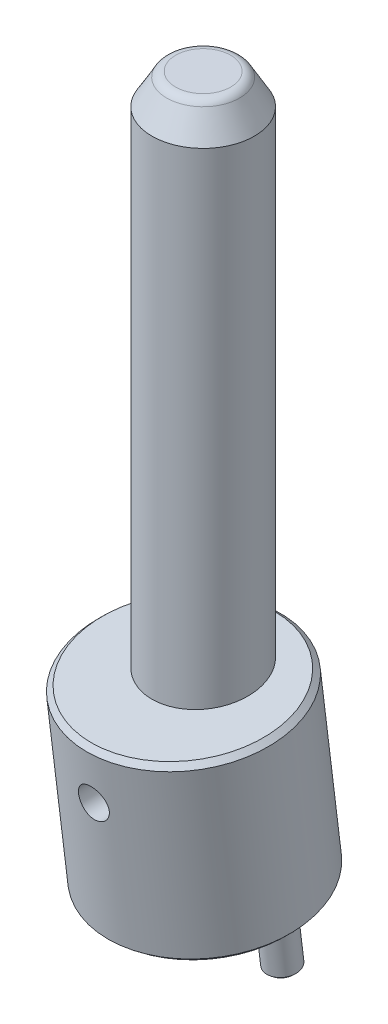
ISO-10303-21;
HEADER;
FILE_DESCRIPTION(('STEP AP214'),'2;1');
FILE_NAME('part.step','',(''),(''),'','','');
FILE_SCHEMA(('AUTOMOTIVE_DESIGN { 1 0 10303 214 1 1 1 1 }'));
ENDSEC;
DATA;
#1=APPLICATION_CONTEXT('core data for automotive mechanical design processes');
#2=APPLICATION_PROTOCOL_DEFINITION('international standard','automotive_design',2000,#1);
#3=PRODUCT_CONTEXT('',#1,'mechanical');
#4=PRODUCT('Part','Part','',(#3));
#5=PRODUCT_RELATED_PRODUCT_CATEGORY('part','',(#4));
#6=PRODUCT_DEFINITION_FORMATION('','',#4);
#7=PRODUCT_DEFINITION_CONTEXT('part definition',#1,'design');
#8=PRODUCT_DEFINITION('design','',#6,#7);
#9=PRODUCT_DEFINITION_SHAPE('','',#8);
#10=(LENGTH_UNIT() NAMED_UNIT(*) SI_UNIT(.MILLI.,.METRE.));
#11=(NAMED_UNIT(*) PLANE_ANGLE_UNIT() SI_UNIT($,.RADIAN.));
#12=(NAMED_UNIT(*) SI_UNIT($,.STERADIAN.) SOLID_ANGLE_UNIT());
#13=UNCERTAINTY_MEASURE_WITH_UNIT(LENGTH_MEASURE(1.E-05),#10,'distance_accuracy_value','');
#14=(GEOMETRIC_REPRESENTATION_CONTEXT(3) GLOBAL_UNCERTAINTY_ASSIGNED_CONTEXT((#13)) GLOBAL_UNIT_ASSIGNED_CONTEXT((#10,
#11,#12)) REPRESENTATION_CONTEXT('',''));
#15=CARTESIAN_POINT('',(0.,0.,0.));
#16=DIRECTION('',(0.,0.,1.));
#17=DIRECTION('',(1.,0.,0.));
#18=AXIS2_PLACEMENT_3D('',#15,#16,#17);
#19=CARTESIAN_POINT('',(0.,130.,0.));
#20=DIRECTION('',(0.,1.,0.));
#21=DIRECTION('',(-1.,0.,0.));
#22=AXIS2_PLACEMENT_3D('',#19,#20,#21);
#23=PLANE('',#22);
#24=CARTESIAN_POINT('',(0.,130.,0.));
#25=DIRECTION('',(0.,-1.,0.));
#26=DIRECTION('',(0.,0.,-1.));
#27=AXIS2_PLACEMENT_3D('',#24,#25,#26);
#28=CIRCLE('',#27,5.381197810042);
#29=CARTESIAN_POINT('',(0.,130.,-5.3811978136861));
#30=VERTEX_POINT('',#29);
#31=CARTESIAN_POINT('',(0.,130.,5.3811978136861));
#32=VERTEX_POINT('',#31);
#33=EDGE_CURVE('P0_E38',#30,#32,#28,.T.);
#34=ORIENTED_EDGE('',*,*,#33,.F.);
#35=CARTESIAN_POINT('',(0.,130.,0.));
#36=DIRECTION('',(0.,-1.,0.));
#37=DIRECTION('',(0.,0.,1.));
#38=AXIS2_PLACEMENT_3D('',#35,#36,#37);
#39=CIRCLE('',#38,5.381197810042);
#40=EDGE_CURVE('P0_E42',#32,#30,#39,.T.);
#41=ORIENTED_EDGE('',*,*,#40,.F.);
#42=EDGE_LOOP('',(#34,#41));
#43=FACE_BOUND('',#42,.T.);
#44=ADVANCED_FACE('P0_F17',(#43),#23,.T.);
#45=CARTESIAN_POINT('',(0.,128.,0.));
#46=DIRECTION('',(0.,1.,0.));
#47=DIRECTION('',(0.00894115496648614,0.,0.999960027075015));
#48=AXIS2_PLACEMENT_3D('',#45,#46,#47);
#49=TOROIDAL_SURFACE('',#48,5.381197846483,2.);
#50=ORIENTED_EDGE('',*,*,#33,.T.);
#51=ORIENTED_EDGE('',*,*,#40,.T.);
#52=EDGE_LOOP('',(#50,#51));
#53=FACE_BOUND('',#52,.T.);
#54=CARTESIAN_POINT('',(0.,129.000000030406,0.));
#55=DIRECTION('',(0.,-1.,0.));
#56=DIRECTION('',(0.,0.,1.));
#57=AXIS2_PLACEMENT_3D('',#54,#55,#56);
#58=CIRCLE('',#57,7.11324863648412);
#59=CARTESIAN_POINT('',(0.,129.000000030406,7.11324863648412));
#60=VERTEX_POINT('',#59);
#61=EDGE_CURVE('P0_E48',#60,#60,#58,.T.);
#62=ORIENTED_EDGE('',*,*,#61,.F.);
#63=EDGE_LOOP('',(#62));
#64=FACE_BOUND('',#63,.T.);
#65=ADVANCED_FACE('P0_F40',(#53,#64),#49,.T.);
#66=CARTESIAN_POINT('',(0.,0.,0.));
#67=DIRECTION('',(0.,1.,0.));
#68=DIRECTION('',(-1.,0.,0.));
#69=AXIS2_PLACEMENT_3D('',#66,#67,#68);
#70=PLANE('',#69);
#71=CARTESIAN_POINT('',(0.,8.84840740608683E-07,0.));
#72=DIRECTION('',(0.,1.,0.));
#73=DIRECTION('',(-1.,0.,0.));
#74=AXIS2_PLACEMENT_3D('',#71,#72,#73);
#75=CIRCLE('',#74,8.99999856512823);
#76=CARTESIAN_POINT('',(-8.99999856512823,8.84840740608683E-07,0.));
#77=VERTEX_POINT('',#76);
#78=EDGE_CURVE('P0_E85',#77,#77,#75,.T.);
#79=ORIENTED_EDGE('',*,*,#78,.F.);
#80=EDGE_LOOP('',(#79));
#81=FACE_BOUND('',#80,.T.);
#82=ADVANCED_FACE('P0_F76',(#81),#70,.F.);
#83=CARTESIAN_POINT('',(0.,17.,3.73205080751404));
#84=DIRECTION('',(0.,0.,1.));
#85=DIRECTION('',(-1.,0.,0.));
#86=AXIS2_PLACEMENT_3D('',#83,#84,#85);
#87=CONICAL_SURFACE('',#86,2.99999999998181,1.04719755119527);
#88=CARTESIAN_POINT('',(0.,16.9999999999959,1.99999999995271));
#89=VERTEX_POINT('',#88);
#90=VERTEX_LOOP('',#89);
#91=FACE_BOUND('',#90,.T.);
#92=CARTESIAN_POINT('',(0.,17.,3.732050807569));
#93=DIRECTION('',(0.,0.,1.));
#94=DIRECTION('',(0.,-1.,0.));
#95=AXIS2_PLACEMENT_3D('',#92,#93,#94);
#96=CIRCLE('',#95,3.);
#97=CARTESIAN_POINT('',(0.,14.,3.732050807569));
#98=VERTEX_POINT('',#97);
#99=EDGE_CURVE('P0_E82',#98,#98,#96,.T.);
#100=ORIENTED_EDGE('',*,*,#99,.T.);
#101=EDGE_LOOP('',(#100));
#102=FACE_BOUND('',#101,.T.);
#103=ADVANCED_FACE('P0_F116',(#91,#102),#87,.F.);
#104=CARTESIAN_POINT('',(0.,123.999999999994,0.));
#105=DIRECTION('',(0.,-1.,0.));
#106=DIRECTION('',(1.,0.,0.));
#107=AXIS2_PLACEMENT_3D('',#104,#105,#106);
#108=CONICAL_SURFACE('',#107,9.9999999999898,0.5235987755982);
#109=CARTESIAN_POINT('',(0.,124.,0.));
#110=DIRECTION('',(0.,1.,0.));
#111=DIRECTION('',(-1.,0.,0.));
#112=AXIS2_PLACEMENT_3D('',#109,#110,#111);
#113=CIRCLE('',#112,10.);
#114=CARTESIAN_POINT('',(-10.,124.,0.));
#115=VERTEX_POINT('',#114);
#116=EDGE_CURVE('P0_E92',#115,#115,#113,.F.);
#117=ORIENTED_EDGE('',*,*,#116,.F.);
#118=EDGE_LOOP('',(#117));
#119=FACE_BOUND('',#118,.T.);
#120=ORIENTED_EDGE('',*,*,#61,.T.);
#121=EDGE_LOOP('',(#120));
#122=FACE_BOUND('',#121,.T.);
#123=ADVANCED_FACE('P0_F108',(#119,#122),#108,.T.);
#124=CARTESIAN_POINT('',(0.,1.00000159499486,0.));
#125=DIRECTION('',(0.,1.,0.));
#126=DIRECTION('',(-1.,0.,0.));
#127=AXIS2_PLACEMENT_3D('',#124,#125,#126);
#128=CONICAL_SURFACE('',#127,9.99999901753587,0.785398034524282);
#129=CARTESIAN_POINT('',(0.,1.000000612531,0.));
#130=DIRECTION('',(0.,1.,0.));
#131=DIRECTION('',(-1.,0.,0.));
#132=AXIS2_PLACEMENT_3D('',#129,#130,#131);
#133=CIRCLE('',#132,10.);
#134=CARTESIAN_POINT('',(-10.,1.000000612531,0.));
#135=VERTEX_POINT('',#134);
#136=EDGE_CURVE('P0_E28',#135,#135,#133,.T.);
#137=ORIENTED_EDGE('',*,*,#136,.F.);
#138=EDGE_LOOP('',(#137));
#139=FACE_BOUND('',#138,.T.);
#140=ORIENTED_EDGE('',*,*,#78,.T.);
#141=EDGE_LOOP('',(#140));
#142=FACE_BOUND('',#141,.T.);
#143=ADVANCED_FACE('P0_F105',(#139,#142),#128,.T.);
#144=CARTESIAN_POINT('',(0.,17.,1.5));
#145=DIRECTION('',(0.,0.,1.));
#146=DIRECTION('',(0.,-1.,0.));
#147=AXIS2_PLACEMENT_3D('',#144,#145,#146);
#148=CYLINDRICAL_SURFACE('',#147,3.);
#149=ORIENTED_EDGE('',*,*,#99,.F.);
#150=EDGE_LOOP('',(#149));
#151=FACE_BOUND('',#150,.T.);
#152=CARTESIAN_POINT('',(0.,14.,10.));
#153=CARTESIAN_POINT('',(-0.164364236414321,14.0000089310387,9.99999407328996));
#154=CARTESIAN_POINT('',(-0.328908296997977,14.0135695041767,9.99590322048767));
#155=CARTESIAN_POINT('',(-0.653366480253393,14.0673818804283,9.9799606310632));
#156=CARTESIAN_POINT('',(-0.813271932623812,14.1076806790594,9.96809523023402));
#157=CARTESIAN_POINT('',(-1.12348315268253,14.2135007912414,9.93790838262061));
#158=CARTESIAN_POINT('',(-1.27380789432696,14.2789703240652,9.91960019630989));
#159=CARTESIAN_POINT('',(-1.56129290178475,14.4330996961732,9.87843514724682));
#160=CARTESIAN_POINT('',(-1.69845550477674,14.5217554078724,9.85557909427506));
#161=CARTESIAN_POINT('',(-1.95973946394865,14.7224452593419,9.80701539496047));
#162=CARTESIAN_POINT('',(-2.08342924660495,14.8350271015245,9.78124907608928));
#163=CARTESIAN_POINT('',(-2.31049290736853,15.0792112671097,9.73011807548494));
#164=CARTESIAN_POINT('',(-2.41386225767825,15.2108178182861,9.70475348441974));
#165=CARTESIAN_POINT('',(-2.59960101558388,15.4929419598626,9.65668220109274));
#166=CARTESIAN_POINT('',(-2.68144668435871,15.6438178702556,9.63404799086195));
#167=CARTESIAN_POINT('',(-2.81842825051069,15.9579795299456,9.59487230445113));
#168=CARTESIAN_POINT('',(-2.87357072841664,16.1212622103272,9.57832932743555));
#169=CARTESIAN_POINT('',(-2.95403265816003,16.4507804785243,9.5538174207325));
#170=CARTESIAN_POINT('',(-2.98014390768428,16.6168053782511,9.54562139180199));
#171=CARTESIAN_POINT('',(-3.00427461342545,16.9510662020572,9.53805579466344));
#172=CARTESIAN_POINT('',(-3.00230085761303,17.1193015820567,9.53868409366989));
#173=CARTESIAN_POINT('',(-2.9709395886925,17.4467673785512,9.54849486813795));
#174=CARTESIAN_POINT('',(-2.94254427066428,17.6061036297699,9.55736772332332));
#175=CARTESIAN_POINT('',(-2.86074869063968,17.9176387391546,9.58216703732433));
#176=CARTESIAN_POINT('',(-2.80734582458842,18.0698368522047,9.59809423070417));
#177=CARTESIAN_POINT('',(-2.67631861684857,18.3652051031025,9.6354552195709));
#178=CARTESIAN_POINT('',(-2.59837186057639,18.5082226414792,9.65696160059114));
#179=CARTESIAN_POINT('',(-2.42069837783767,18.7794716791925,9.70302119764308));
#180=CARTESIAN_POINT('',(-2.32096766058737,18.9077004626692,9.7275749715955));
#181=CARTESIAN_POINT('',(-2.09764727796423,19.1513495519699,9.77821549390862));
#182=CARTESIAN_POINT('',(-1.97323765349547,19.2660150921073,9.80432352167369));
#183=CARTESIAN_POINT('',(-1.7065766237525,19.4730741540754,9.85423611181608));
#184=CARTESIAN_POINT('',(-1.56431758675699,19.5654580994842,9.87803968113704));
#185=CARTESIAN_POINT('',(-1.26458300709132,19.7257915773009,9.92088257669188));
#186=CARTESIAN_POINT('',(-1.10700242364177,19.7935547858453,9.93988525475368));
#187=CARTESIAN_POINT('',(-0.782158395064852,19.9012737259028,9.97069163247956));
#188=CARTESIAN_POINT('',(-0.61491570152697,19.9412868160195,9.9825101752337));
#189=CARTESIAN_POINT('',(-0.371824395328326,19.9778051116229,9.99335985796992));
#190=CARTESIAN_POINT('',(-0.297737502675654,19.9861188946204,9.99584304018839));
#191=CARTESIAN_POINT('',(-0.14911274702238,19.9972183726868,9.99916445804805));
#192=CARTESIAN_POINT('',(-0.0745748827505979,20.000004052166,10.0000026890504));
#193=CARTESIAN_POINT('',(0.164364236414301,19.9999910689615,9.99999407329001));
#194=CARTESIAN_POINT('',(0.328908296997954,19.9864304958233,9.99590322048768));
#195=CARTESIAN_POINT('',(0.653366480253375,19.9326181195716,9.97996063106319));
#196=CARTESIAN_POINT('',(0.813271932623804,19.8923193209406,9.96809523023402));
#197=CARTESIAN_POINT('',(1.12348315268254,19.7864992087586,9.93790838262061));
#198=CARTESIAN_POINT('',(1.27380789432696,19.7210296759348,9.91960019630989));
#199=CARTESIAN_POINT('',(1.56129290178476,19.5669003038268,9.87843514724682));
#200=CARTESIAN_POINT('',(1.69845550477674,19.4782445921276,9.85557909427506));
#201=CARTESIAN_POINT('',(1.95973946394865,19.2775547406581,9.80701539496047));
#202=CARTESIAN_POINT('',(2.08342924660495,19.1649728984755,9.78124907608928));
#203=CARTESIAN_POINT('',(2.31049290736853,18.9207887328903,9.73011807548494));
#204=CARTESIAN_POINT('',(2.41386225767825,18.7891821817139,9.70475348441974));
#205=CARTESIAN_POINT('',(2.59960101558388,18.5070580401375,9.65668220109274));
#206=CARTESIAN_POINT('',(2.68144668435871,18.3561821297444,9.63404799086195));
#207=CARTESIAN_POINT('',(2.81842825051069,18.0420204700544,9.59487230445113));
#208=CARTESIAN_POINT('',(2.87357072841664,17.8787377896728,9.57832932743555));
#209=CARTESIAN_POINT('',(2.95403265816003,17.5492195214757,9.5538174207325));
#210=CARTESIAN_POINT('',(2.98014390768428,17.3831946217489,9.54562139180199));
#211=CARTESIAN_POINT('',(3.00427461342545,17.0489337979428,9.53805579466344));
#212=CARTESIAN_POINT('',(3.00230085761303,16.8806984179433,9.53868409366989));
#213=CARTESIAN_POINT('',(2.9709395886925,16.5532326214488,9.54849486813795));
#214=CARTESIAN_POINT('',(2.94254427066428,16.3938963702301,9.55736772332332));
#215=CARTESIAN_POINT('',(2.86074869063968,16.0823612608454,9.58216703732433));
#216=CARTESIAN_POINT('',(2.80734582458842,15.9301631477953,9.59809423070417));
#217=CARTESIAN_POINT('',(2.67631861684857,15.6347948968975,9.6354552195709));
#218=CARTESIAN_POINT('',(2.59837186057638,15.4917773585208,9.65696160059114));
#219=CARTESIAN_POINT('',(2.42069837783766,15.2205283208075,9.70302119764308));
#220=CARTESIAN_POINT('',(2.32096766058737,15.0922995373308,9.7275749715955));
#221=CARTESIAN_POINT('',(2.09764727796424,14.8486504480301,9.77821549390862));
#222=CARTESIAN_POINT('',(1.97323765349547,14.7339849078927,9.80432352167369));
#223=CARTESIAN_POINT('',(1.7065766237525,14.5269258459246,9.85423611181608));
#224=CARTESIAN_POINT('',(1.56431758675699,14.4345419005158,9.87803968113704));
#225=CARTESIAN_POINT('',(1.26458300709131,14.2742084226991,9.92088257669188));
#226=CARTESIAN_POINT('',(1.10700242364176,14.2064452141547,9.93988525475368));
#227=CARTESIAN_POINT('',(0.782158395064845,14.0987262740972,9.97069163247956));
#228=CARTESIAN_POINT('',(0.614915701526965,14.0587131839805,9.9825101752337));
#229=CARTESIAN_POINT('',(0.371824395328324,14.0221948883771,9.99335985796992));
#230=CARTESIAN_POINT('',(0.297737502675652,14.0138811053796,9.9958430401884));
#231=CARTESIAN_POINT('',(0.149112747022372,14.0027816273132,9.99916445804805));
#232=CARTESIAN_POINT('',(0.0745748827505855,13.999995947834,10.0000026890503));
#233=CARTESIAN_POINT('',(0.,14.,10.));
#234=B_SPLINE_CURVE_WITH_KNOTS('',3,(#152,#153,#154,#155,#156,#157,#158,#159,#160,#161,#162,
#163,#164,#165,#166,#167,#168,#169,#170,#171,#172,#173,#174,#175,#176,#177,#178,#179,#180,#181,
#182,#183,#184,#185,#186,#187,#188,#189,#190,#191,#192,#193,#194,#195,#196,#197,#198,#199,#200,
#201,#202,#203,#204,#205,#206,#207,#208,#209,#210,#211,#212,#213,#214,#215,#216,#217,#218,#219,
#220,#221,#222,#223,#224,#225,#226,#227,#228,#229,#230,#231,#232,#233),.UNSPECIFIED.,.T.,.F.,(4,
2,2,2,2,2,2,2,2,2,2,2,2,2,2,2,2,2,2,2,2,2,2,2,2,2,2,2,2,2,2,2,2,2,2,2,2,2,2,2,4),(0.,
0.49280574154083,0.98647994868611,1.47914396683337,1.97172034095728,2.47709830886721,
2.98258875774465,3.49943124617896,4.01614630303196,4.51839363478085,5.02051957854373,
5.50451902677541,5.98856888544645,6.47926306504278,6.97004721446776,7.48124851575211,
7.99266913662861,8.507883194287,9.02202912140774,9.24562293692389,9.4692173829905,
9.96202312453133,10.4556973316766,10.9483613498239,11.4409377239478,11.9463156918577,
12.4518061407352,12.9686486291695,13.4853636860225,13.9876110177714,14.4897369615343,
14.9737364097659,15.457786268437,15.9484804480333,16.4392645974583,16.9504658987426,
17.4618865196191,17.9771005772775,18.4912465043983,18.7148403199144,18.938434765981),.UNSPECIFIED.);
#235=CARTESIAN_POINT('',(0.,14.,10.));
#236=VERTEX_POINT('',#235);
#237=EDGE_CURVE('P0_E11',#236,#236,#234,.T.);
#238=ORIENTED_EDGE('',*,*,#237,.F.);
#239=EDGE_LOOP('',(#238));
#240=FACE_BOUND('',#239,.T.);
#241=ADVANCED_FACE('P0_F107',(#151,#240),#148,.F.);
#242=CARTESIAN_POINT('',(0.,-6.5,0.));
#243=DIRECTION('',(0.,1.,0.));
#244=DIRECTION('',(-1.,0.,0.));
#245=AXIS2_PLACEMENT_3D('',#242,#243,#244);
#246=CYLINDRICAL_SURFACE('',#245,10.);
#247=ORIENTED_EDGE('',*,*,#116,.T.);
#248=EDGE_LOOP('',(#247));
#249=FACE_BOUND('',#248,.T.);
#250=ORIENTED_EDGE('',*,*,#136,.T.);
#251=EDGE_LOOP('',(#250));
#252=FACE_BOUND('',#251,.T.);
#253=ORIENTED_EDGE('',*,*,#237,.T.);
#254=EDGE_LOOP('',(#253));
#255=FACE_BOUND('',#254,.T.);
#256=ADVANCED_FACE('P0_F102',(#249,#252,#255),#246,.T.);
#257=CLOSED_SHELL('',(#44,#65,#82,#103,#123,#143,#241,#256));
#258=MANIFOLD_SOLID_BREP('P0_B1',#257);
#259=CARTESIAN_POINT('',(0.,-15.1520541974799,-1.51393584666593));
#260=DIRECTION('',(0.,-0.992546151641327,-0.121869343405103));
#261=DIRECTION('',(0.,0.121869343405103,-0.992546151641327));
#262=AXIS2_PLACEMENT_3D('',#259,#260,#261);
#263=PLANE('',#262);
#264=CARTESIAN_POINT('',(-14.,-15.1520541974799,-1.51393584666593));
#265=DIRECTION('',(0.,-0.992546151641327,-0.121869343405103));
#266=DIRECTION('',(0.,0.121869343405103,-0.992546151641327));
#267=AXIS2_PLACEMENT_3D('',#264,#265,#266);
#268=CIRCLE('',#267,2.49998893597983);
#269=CARTESIAN_POINT('',(-14.,-14.8473821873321,-3.99529024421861));
#270=VERTEX_POINT('',#269);
#271=EDGE_CURVE('P1_E17',#270,#270,#268,.F.);
#272=ORIENTED_EDGE('',*,*,#271,.F.);
#273=EDGE_LOOP('',(#272));
#274=FACE_BOUND('',#273,.T.);
#275=ADVANCED_FACE('P1_F14',(#274),#263,.T.);
#276=CARTESIAN_POINT('',(0.,-15.1520541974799,-1.51393584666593));
#277=DIRECTION('',(0.,-0.992546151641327,-0.121869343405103));
#278=DIRECTION('',(0.,0.121869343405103,-0.992546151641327));
#279=AXIS2_PLACEMENT_3D('',#276,#277,#278);
#280=PLANE('',#279);
#281=CARTESIAN_POINT('',(14.,-15.1520541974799,-1.51393584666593));
#282=DIRECTION('',(0.,-0.992546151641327,-0.121869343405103));
#283=DIRECTION('',(0.,0.121869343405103,-0.992546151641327));
#284=AXIS2_PLACEMENT_3D('',#281,#282,#283);
#285=CIRCLE('',#284,2.49998893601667);
#286=CARTESIAN_POINT('',(14.,-14.8473821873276,-3.99529024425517));
#287=VERTEX_POINT('',#286);
#288=EDGE_CURVE('P1_E114',#287,#287,#285,.F.);
#289=ORIENTED_EDGE('',*,*,#288,.F.);
#290=EDGE_LOOP('',(#289));
#291=FACE_BOUND('',#290,.T.);
#292=ADVANCED_FACE('P1_F104',(#291),#280,.T.);
#293=CARTESIAN_POINT('',(0.,-1.32706345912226E-13,-3.20815422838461E-13));
#294=DIRECTION('',(0.,-1.,0.));
#295=DIRECTION('',(0.,0.,-1.));
#296=AXIS2_PLACEMENT_3D('',#293,#294,#295);
#297=PLANE('',#296);
#298=CARTESIAN_POINT('',(0.,0.,-2.03098171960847E-12));
#299=DIRECTION('',(0.,-1.,0.));
#300=DIRECTION('',(0.,0.,-1.));
#301=AXIS2_PLACEMENT_3D('',#298,#299,#300);
#302=CIRCLE('',#301,10.);
#303=CARTESIAN_POINT('',(0.,0.,-10.000000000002));
#304=VERTEX_POINT('',#303);
#305=EDGE_CURVE('P1_E116',#304,#304,#302,.F.);
#306=ORIENTED_EDGE('',*,*,#305,.T.);
#307=EDGE_LOOP('',(#306));
#308=FACE_BOUND('',#307,.T.);
#309=ADVANCED_FACE('P1_F101',(#308),#297,.F.);
#310=CARTESIAN_POINT('',(-14.,-14.6557726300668,-1.45300013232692));
#311=DIRECTION('',(0.,0.992546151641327,0.121869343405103));
#312=DIRECTION('',(0.,-0.121869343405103,0.992546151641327));
#313=AXIS2_PLACEMENT_3D('',#310,#311,#312);
#314=CONICAL_SURFACE('',#313,2.99999527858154,0.785395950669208);
#315=CARTESIAN_POINT('',(-14.,-14.6557679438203,-1.4529995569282));
#316=DIRECTION('',(0.,0.992546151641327,0.121869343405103));
#317=DIRECTION('',(0.,-0.121869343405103,0.992546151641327));
#318=AXIS2_PLACEMENT_3D('',#315,#316,#317);
#319=CIRCLE('',#318,3.);
#320=CARTESIAN_POINT('',(-14.,-15.0213759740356,1.52463889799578));
#321=VERTEX_POINT('',#320);
#322=EDGE_CURVE('P1_E118',#321,#321,#319,.T.);
#323=ORIENTED_EDGE('',*,*,#322,.F.);
#324=EDGE_LOOP('',(#323));
#325=FACE_BOUND('',#324,.T.);
#326=ORIENTED_EDGE('',*,*,#271,.T.);
#327=EDGE_LOOP('',(#326));
#328=FACE_BOUND('',#327,.T.);
#329=ADVANCED_FACE('P1_F97',(#325,#328),#314,.T.);
#330=CARTESIAN_POINT('',(14.,-14.6557726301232,-1.45300013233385));
#331=DIRECTION('',(0.,0.992546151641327,0.121869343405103));
#332=DIRECTION('',(0.,-0.121869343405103,0.992546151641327));
#333=AXIS2_PLACEMENT_3D('',#330,#331,#332);
#334=CONICAL_SURFACE('',#333,2.99999527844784,0.785395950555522);
#335=CARTESIAN_POINT('',(14.,-14.655767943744,-1.45299955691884));
#336=DIRECTION('',(0.,0.992546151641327,0.121869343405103));
#337=DIRECTION('',(0.,-0.121869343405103,0.992546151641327));
#338=AXIS2_PLACEMENT_3D('',#335,#336,#337);
#339=CIRCLE('',#338,3.);
#340=CARTESIAN_POINT('',(14.,-15.0213759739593,1.52463889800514));
#341=VERTEX_POINT('',#340);
#342=EDGE_CURVE('P1_E123',#341,#341,#339,.T.);
#343=ORIENTED_EDGE('',*,*,#342,.F.);
#344=EDGE_LOOP('',(#343));
#345=FACE_BOUND('',#344,.T.);
#346=ORIENTED_EDGE('',*,*,#288,.T.);
#347=EDGE_LOOP('',(#346));
#348=FACE_BOUND('',#347,.T.);
#349=ADVANCED_FACE('P1_F92',(#345,#348),#334,.T.);
#350=CARTESIAN_POINT('',(0.,43.3305704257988,-2.03092750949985E-12));
#351=DIRECTION('',(0.,-1.,0.));
#352=DIRECTION('',(0.,0.,-1.));
#353=AXIS2_PLACEMENT_3D('',#350,#351,#352);
#354=CYLINDRICAL_SURFACE('',#353,10.);
#355=CARTESIAN_POINT('',(0.,30.0000000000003,-2.03092750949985E-12));
#356=DIRECTION('',(0.,0.992546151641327,0.121869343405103));
#357=DIRECTION('',(0.,-0.121869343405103,0.992546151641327));
#358=AXIS2_PLACEMENT_3D('',#355,#356,#357);
#359=ELLIPSE('',#358,10.0750982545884,10.);
#360=CARTESIAN_POINT('',(0.,28.7721543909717,9.99999999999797));
#361=VERTEX_POINT('',#360);
#362=EDGE_CURVE('P1_E79',#361,#361,#359,.F.);
#363=ORIENTED_EDGE('',*,*,#362,.F.);
#364=EDGE_LOOP('',(#363));
#365=FACE_BOUND('',#364,.T.);
#366=ORIENTED_EDGE('',*,*,#305,.F.);
#367=EDGE_LOOP('',(#366));
#368=FACE_BOUND('',#367,.T.);
#369=CARTESIAN_POINT('',(0.,20.0000000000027,9.99999999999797));
#370=CARTESIAN_POINT('',(-0.16436423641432,19.999991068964,9.99999407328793));
#371=CARTESIAN_POINT('',(-0.328908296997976,19.986430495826,9.99590322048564));
#372=CARTESIAN_POINT('',(-0.653366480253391,19.9326181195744,9.97996063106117));
#373=CARTESIAN_POINT('',(-0.81327193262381,19.8923193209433,9.96809523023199));
#374=CARTESIAN_POINT('',(-1.12348315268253,19.7864992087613,9.93790838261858));
#375=CARTESIAN_POINT('',(-1.27380789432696,19.7210296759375,9.91960019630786));
#376=CARTESIAN_POINT('',(-1.56129290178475,19.5669003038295,9.87843514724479));
#377=CARTESIAN_POINT('',(-1.69845550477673,19.4782445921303,9.85557909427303));
#378=CARTESIAN_POINT('',(-1.95973946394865,19.2775547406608,9.80701539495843));
#379=CARTESIAN_POINT('',(-2.08342924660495,19.1649728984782,9.78124907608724));
#380=CARTESIAN_POINT('',(-2.31049290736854,18.920788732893,9.73011807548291));
#381=CARTESIAN_POINT('',(-2.41386225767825,18.7891821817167,9.70475348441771));
#382=CARTESIAN_POINT('',(-2.59960101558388,18.5070580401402,9.65668220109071));
#383=CARTESIAN_POINT('',(-2.68144668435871,18.3561821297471,9.63404799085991));
#384=CARTESIAN_POINT('',(-2.81842825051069,18.0420204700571,9.5948723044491));
#385=CARTESIAN_POINT('',(-2.87357072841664,17.8787377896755,9.57832932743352));
#386=CARTESIAN_POINT('',(-2.95403265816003,17.5492195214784,9.55381742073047));
#387=CARTESIAN_POINT('',(-2.98014390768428,17.3831946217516,9.54562139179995));
#388=CARTESIAN_POINT('',(-3.00427461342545,17.0489337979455,9.53805579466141));
#389=CARTESIAN_POINT('',(-3.00230085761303,16.8806984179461,9.53868409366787));
#390=CARTESIAN_POINT('',(-2.9709395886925,16.5532326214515,9.54849486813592));
#391=CARTESIAN_POINT('',(-2.94254427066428,16.3938963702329,9.55736772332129));
#392=CARTESIAN_POINT('',(-2.86074869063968,16.0823612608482,9.5821670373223));
#393=CARTESIAN_POINT('',(-2.80734582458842,15.9301631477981,9.59809423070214));
#394=CARTESIAN_POINT('',(-2.67631861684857,15.6347948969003,9.63545521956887));
#395=CARTESIAN_POINT('',(-2.59837186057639,15.4917773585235,9.65696160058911));
#396=CARTESIAN_POINT('',(-2.42069837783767,15.2205283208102,9.70302119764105));
#397=CARTESIAN_POINT('',(-2.32096766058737,15.0922995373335,9.72757497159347));
#398=CARTESIAN_POINT('',(-2.09764727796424,14.8486504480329,9.77821549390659));
#399=CARTESIAN_POINT('',(-1.97323765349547,14.7339849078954,9.80432352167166));
#400=CARTESIAN_POINT('',(-1.7065766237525,14.5269258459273,9.85423611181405));
#401=CARTESIAN_POINT('',(-1.56431758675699,14.4345419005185,9.87803968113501));
#402=CARTESIAN_POINT('',(-1.26458300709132,14.2742084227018,9.92088257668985));
#403=CARTESIAN_POINT('',(-1.10700242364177,14.2064452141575,9.93988525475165));
#404=CARTESIAN_POINT('',(-0.782158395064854,14.0987262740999,9.97069163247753));
#405=CARTESIAN_POINT('',(-0.614915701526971,14.0587131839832,9.98251017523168));
#406=CARTESIAN_POINT('',(-0.371824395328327,14.0221948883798,9.99335985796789));
#407=CARTESIAN_POINT('',(-0.297737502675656,14.0138811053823,9.99584304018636));
#408=CARTESIAN_POINT('',(-0.149112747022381,14.0027816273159,9.99916445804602));
#409=CARTESIAN_POINT('',(-0.0745748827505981,13.9999959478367,10.0000026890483));
#410=CARTESIAN_POINT('',(0.164364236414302,14.0000089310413,9.99999407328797));
#411=CARTESIAN_POINT('',(0.328908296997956,14.0135695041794,9.99590322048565));
#412=CARTESIAN_POINT('',(0.653366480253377,14.0673818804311,9.97996063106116));
#413=CARTESIAN_POINT('',(0.813271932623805,14.1076806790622,9.96809523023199));
#414=CARTESIAN_POINT('',(1.12348315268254,14.2135007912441,9.93790838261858));
#415=CARTESIAN_POINT('',(1.27380789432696,14.2789703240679,9.91960019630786));
#416=CARTESIAN_POINT('',(1.56129290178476,14.4330996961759,9.87843514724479));
#417=CARTESIAN_POINT('',(1.69845550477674,14.5217554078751,9.85557909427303));
#418=CARTESIAN_POINT('',(1.95973946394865,14.7224452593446,9.80701539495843));
#419=CARTESIAN_POINT('',(2.08342924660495,14.8350271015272,9.78124907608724));
#420=CARTESIAN_POINT('',(2.31049290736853,15.0792112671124,9.73011807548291));
#421=CARTESIAN_POINT('',(2.41386225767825,15.2108178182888,9.70475348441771));
#422=CARTESIAN_POINT('',(2.59960101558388,15.4929419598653,9.65668220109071));
#423=CARTESIAN_POINT('',(2.68144668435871,15.6438178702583,9.63404799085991));
#424=CARTESIAN_POINT('',(2.81842825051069,15.9579795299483,9.5948723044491));
#425=CARTESIAN_POINT('',(2.87357072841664,16.1212622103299,9.57832932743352));
#426=CARTESIAN_POINT('',(2.95403265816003,16.450780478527,9.55381742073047));
#427=CARTESIAN_POINT('',(2.98014390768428,16.6168053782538,9.54562139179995));
#428=CARTESIAN_POINT('',(3.00427461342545,16.9510662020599,9.53805579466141));
#429=CARTESIAN_POINT('',(3.00230085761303,17.1193015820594,9.53868409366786));
#430=CARTESIAN_POINT('',(2.9709395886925,17.4467673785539,9.54849486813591));
#431=CARTESIAN_POINT('',(2.94254427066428,17.6061036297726,9.55736772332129));
#432=CARTESIAN_POINT('',(2.86074869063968,17.9176387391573,9.5821670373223));
#433=CARTESIAN_POINT('',(2.80734582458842,18.0698368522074,9.59809423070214));
#434=CARTESIAN_POINT('',(2.67631861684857,18.3652051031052,9.63545521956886));
#435=CARTESIAN_POINT('',(2.59837186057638,18.5082226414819,9.65696160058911));
#436=CARTESIAN_POINT('',(2.42069837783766,18.7794716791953,9.70302119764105));
#437=CARTESIAN_POINT('',(2.32096766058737,18.9077004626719,9.72757497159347));
#438=CARTESIAN_POINT('',(2.09764727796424,19.1513495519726,9.77821549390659));
#439=CARTESIAN_POINT('',(1.97323765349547,19.26601509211,9.80432352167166));
#440=CARTESIAN_POINT('',(1.7065766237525,19.4730741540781,9.85423611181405));
#441=CARTESIAN_POINT('',(1.56431758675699,19.5654580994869,9.87803968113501));
#442=CARTESIAN_POINT('',(1.26458300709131,19.7257915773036,9.92088257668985));
#443=CARTESIAN_POINT('',(1.10700242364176,19.793554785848,9.93988525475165));
#444=CARTESIAN_POINT('',(0.782158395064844,19.9012737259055,9.97069163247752));
#445=CARTESIAN_POINT('',(0.614915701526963,19.9412868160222,9.98251017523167));
#446=CARTESIAN_POINT('',(0.371824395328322,19.9778051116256,9.99335985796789));
#447=CARTESIAN_POINT('',(0.297737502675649,19.9861188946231,9.99584304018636));
#448=CARTESIAN_POINT('',(0.149112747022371,19.9972183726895,9.99916445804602));
#449=CARTESIAN_POINT('',(0.0745748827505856,20.0000040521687,10.0000026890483));
#450=CARTESIAN_POINT('',(0.,20.0000000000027,9.99999999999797));
#451=B_SPLINE_CURVE_WITH_KNOTS('',3,(#369,#370,#371,#372,#373,#374,#375,#376,#377,#378,#379,
#380,#381,#382,#383,#384,#385,#386,#387,#388,#389,#390,#391,#392,#393,#394,#395,#396,#397,#398,
#399,#400,#401,#402,#403,#404,#405,#406,#407,#408,#409,#410,#411,#412,#413,#414,#415,#416,#417,
#418,#419,#420,#421,#422,#423,#424,#425,#426,#427,#428,#429,#430,#431,#432,#433,#434,#435,#436,
#437,#438,#439,#440,#441,#442,#443,#444,#445,#446,#447,#448,#449,#450),.UNSPECIFIED.,.T.,.F.,(4,
2,2,2,2,2,2,2,2,2,2,2,2,2,2,2,2,2,2,2,2,2,2,2,2,2,2,2,2,2,2,2,2,2,2,2,2,2,2,2,4),(0.,
0.49280574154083,0.986479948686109,1.47914396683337,1.97172034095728,2.47709830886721,
2.98258875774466,3.49943124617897,4.01614630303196,4.51839363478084,5.02051957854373,
5.50451902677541,5.98856888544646,6.47926306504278,6.97004721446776,7.48124851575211,
7.99266913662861,8.507883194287,9.02202912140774,9.24562293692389,9.46921738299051,
9.96202312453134,10.4556973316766,10.9483613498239,11.4409377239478,11.9463156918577,
12.4518061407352,12.9686486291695,13.4853636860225,13.9876110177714,14.4897369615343,
14.9737364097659,15.457786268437,15.9484804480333,16.4392645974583,16.9504658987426,
17.4618865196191,17.9771005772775,18.4912465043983,18.7148403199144,18.9384347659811),.UNSPECIFIED.);
#452=CARTESIAN_POINT('',(0.,20.0000000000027,9.99999999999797));
#453=VERTEX_POINT('',#452);
#454=EDGE_CURVE('P1_E76',#453,#453,#451,.T.);
#455=ORIENTED_EDGE('',*,*,#454,.T.);
#456=EDGE_LOOP('',(#455));
#457=FACE_BOUND('',#456,.T.);
#458=ADVANCED_FACE('P1_F86',(#365,#368,#457),#354,.F.);
#459=CARTESIAN_POINT('',(-14.,-6.219138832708,-0.41711175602));
#460=DIRECTION('',(0.,-0.992546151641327,-0.121869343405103));
#461=DIRECTION('',(0.,0.121869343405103,-0.992546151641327));
#462=AXIS2_PLACEMENT_3D('',#459,#460,#461);
#463=CYLINDRICAL_SURFACE('',#462,3.);
#464=CARTESIAN_POINT('',(-14.,-6.219138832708,-0.41711175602));
#465=DIRECTION('',(0.,-0.992546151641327,-0.121869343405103));
#466=DIRECTION('',(0.,0.121869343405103,-0.992546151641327));
#467=AXIS2_PLACEMENT_3D('',#464,#465,#466);
#468=CIRCLE('',#467,3.);
#469=CARTESIAN_POINT('',(-14.,-5.85353080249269,-3.39475021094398));
#470=VERTEX_POINT('',#469);
#471=EDGE_CURVE('P1_E72',#470,#470,#468,.T.);
#472=ORIENTED_EDGE('',*,*,#471,.T.);
#473=EDGE_LOOP('',(#472));
#474=FACE_BOUND('',#473,.T.);
#475=ORIENTED_EDGE('',*,*,#322,.T.);
#476=EDGE_LOOP('',(#475));
#477=FACE_BOUND('',#476,.T.);
#478=ADVANCED_FACE('P1_F91',(#474,#477),#463,.T.);
#479=CARTESIAN_POINT('',(14.,-6.219138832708,-0.41711175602));
#480=DIRECTION('',(0.,-0.992546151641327,-0.121869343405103));
#481=DIRECTION('',(0.,0.121869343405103,-0.992546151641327));
#482=AXIS2_PLACEMENT_3D('',#479,#480,#481);
#483=CYLINDRICAL_SURFACE('',#482,3.);
#484=CARTESIAN_POINT('',(14.,-6.219138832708,-0.41711175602));
#485=DIRECTION('',(0.,-0.992546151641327,-0.121869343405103));
#486=DIRECTION('',(0.,0.121869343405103,-0.992546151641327));
#487=AXIS2_PLACEMENT_3D('',#484,#485,#486);
#488=CIRCLE('',#487,3.);
#489=CARTESIAN_POINT('',(14.,-5.85353080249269,-3.39475021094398));
#490=VERTEX_POINT('',#489);
#491=EDGE_CURVE('P1_E68',#490,#490,#488,.T.);
#492=ORIENTED_EDGE('',*,*,#491,.T.);
#493=EDGE_LOOP('',(#492));
#494=FACE_BOUND('',#493,.T.);
#495=ORIENTED_EDGE('',*,*,#342,.T.);
#496=EDGE_LOOP('',(#495));
#497=FACE_BOUND('',#496,.T.);
#498=ADVANCED_FACE('P1_F139',(#494,#497),#483,.T.);
#499=CARTESIAN_POINT('',(0.,29.5125226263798,3.97018460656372));
#500=DIRECTION('',(0.,0.992546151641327,0.121869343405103));
#501=DIRECTION('',(0.,-0.121869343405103,0.992546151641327));
#502=AXIS2_PLACEMENT_3D('',#499,#500,#501);
#503=PLANE('',#502);
#504=ORIENTED_EDGE('',*,*,#362,.T.);
#505=EDGE_LOOP('',(#504));
#506=FACE_BOUND('',#505,.T.);
#507=CARTESIAN_POINT('',(0.,29.5125226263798,3.9701846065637));
#508=DIRECTION('',(0.,0.992546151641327,0.121869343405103));
#509=DIRECTION('',(0.,-0.121869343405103,0.992546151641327));
#510=AXIS2_PLACEMENT_3D('',#507,#508,#509);
#511=CIRCLE('',#510,17.9999935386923);
#512=CARTESIAN_POINT('',(0.,27.3188752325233,21.8360089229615));
#513=VERTEX_POINT('',#512);
#514=EDGE_CURVE('P1_E38',#513,#513,#511,.F.);
#515=ORIENTED_EDGE('',*,*,#514,.F.);
#516=EDGE_LOOP('',(#515));
#517=FACE_BOUND('',#516,.T.);
#518=ADVANCED_FACE('P1_F63',(#506,#517),#503,.T.);
#519=CARTESIAN_POINT('',(0.,17.0000000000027,-3.70003727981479));
#520=DIRECTION('',(0.,0.,1.));
#521=DIRECTION('',(0.,-1.,0.));
#522=AXIS2_PLACEMENT_3D('',#519,#520,#521);
#523=CYLINDRICAL_SURFACE('',#522,3.);
#524=ORIENTED_EDGE('',*,*,#454,.F.);
#525=EDGE_LOOP('',(#524));
#526=FACE_BOUND('',#525,.T.);
#527=CARTESIAN_POINT('',(0.,14.0000000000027,21.2081730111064));
#528=CARTESIAN_POINT('',(-0.168375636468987,14.000007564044,21.2081708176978));
#529=CARTESIAN_POINT('',(-0.336958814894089,14.0142312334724,21.2076402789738));
#530=CARTESIAN_POINT('',(-0.669566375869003,14.0707956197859,21.2057130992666));
#531=CARTESIAN_POINT('',(-0.833581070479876,14.1131919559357,21.2043147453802));
#532=CARTESIAN_POINT('',(-1.15205522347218,14.2248959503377,21.2012396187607));
#533=CARTESIAN_POINT('',(-1.30652215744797,14.2941822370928,21.1995630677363));
#534=CARTESIAN_POINT('',(-1.60156617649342,14.4576731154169,21.1968228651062));
#535=CARTESIAN_POINT('',(-1.74214908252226,14.5518672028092,21.1957589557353));
#536=CARTESIAN_POINT('',(-2.00554261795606,14.7625371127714,21.1953276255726));
#537=CARTESIAN_POINT('',(-2.12834999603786,14.8790170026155,21.1959605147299));
#538=CARTESIAN_POINT('',(-2.3526557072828,15.1309218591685,21.2000562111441));
#539=CARTESIAN_POINT('',(-2.45415323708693,15.2663475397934,21.2035191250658));
#540=CARTESIAN_POINT('',(-2.63254643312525,15.551595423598,21.2142654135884));
#541=CARTESIAN_POINT('',(-2.70954499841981,15.7013538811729,21.2215324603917));
#542=CARTESIAN_POINT('',(-2.83737969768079,16.0113712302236,21.2405952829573));
#543=CARTESIAN_POINT('',(-2.88821737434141,16.1716295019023,21.252390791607));
#544=CARTESIAN_POINT('',(-2.96225674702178,16.4972232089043,21.2807457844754));
#545=CARTESIAN_POINT('',(-2.98558245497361,16.6625323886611,21.2972834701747));
#546=CARTESIAN_POINT('',(-3.00459042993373,16.9942055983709,21.3349508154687));
#547=CARTESIAN_POINT('',(-3.00027160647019,17.1605696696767,21.3560806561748));
#548=CARTESIAN_POINT('',(-2.9642365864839,17.4910773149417,21.4024316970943));
#549=CARTESIAN_POINT('',(-2.93230247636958,17.65519265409,21.4276841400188));
#550=CARTESIAN_POINT('',(-2.84186394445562,17.9754520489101,21.4810141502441));
#551=CARTESIAN_POINT('',(-2.78335584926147,18.1315949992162,21.5090921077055));
#552=CARTESIAN_POINT('',(-2.64001667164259,18.4349283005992,21.5671655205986));
#553=CARTESIAN_POINT('',(-2.55467438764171,18.5818719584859,21.5971883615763));
#554=CARTESIAN_POINT('',(-2.36040600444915,18.8593465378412,21.6567869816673));
#555=CARTESIAN_POINT('',(-2.25147933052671,18.9898770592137,21.6863627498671));
#556=CARTESIAN_POINT('',(-2.0116154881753,19.2322107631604,21.7434078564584));
#557=CARTESIAN_POINT('',(-1.88046287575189,19.3438068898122,21.7708523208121));
#558=CARTESIAN_POINT('',(-1.60035758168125,19.5433076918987,21.8213051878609));
#559=CARTESIAN_POINT('',(-1.45139855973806,19.6312038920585,21.8443120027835));
#560=CARTESIAN_POINT('',(-1.14272283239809,19.7790218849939,21.883718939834));
#561=CARTESIAN_POINT('',(-0.983245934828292,19.8394155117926,21.9002297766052));
#562=CARTESIAN_POINT('',(-0.656050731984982,19.9323006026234,21.9258599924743));
#563=CARTESIAN_POINT('',(-0.488353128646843,19.9648586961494,21.9349970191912));
#564=CARTESIAN_POINT('',(-0.266232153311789,19.9886415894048,21.9416818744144));
#565=CARTESIAN_POINT('',(-0.213088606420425,19.992897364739,21.9428794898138));
#566=CARTESIAN_POINT('',(-0.106637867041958,19.9985778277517,21.9444793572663));
#567=CARTESIAN_POINT('',(-0.0533306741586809,20.0000025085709,21.9448816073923));
#568=CARTESIAN_POINT('',(0.164356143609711,19.9999922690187,21.9448765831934));
#569=CARTESIAN_POINT('',(0.328935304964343,19.9864295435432,21.9410406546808));
#570=CARTESIAN_POINT('',(0.653541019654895,19.9325856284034,21.9259781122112));
#571=CARTESIAN_POINT('',(0.813557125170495,19.8922475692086,21.9147357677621));
#572=CARTESIAN_POINT('',(1.12402944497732,19.7862873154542,21.8857527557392));
#573=CARTESIAN_POINT('',(1.27450305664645,19.7207127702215,21.8680243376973));
#574=CARTESIAN_POINT('',(1.56216881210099,19.5663745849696,21.8273798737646));
#575=CARTESIAN_POINT('',(1.69936540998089,19.4776187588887,21.804465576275));
#576=CARTESIAN_POINT('',(1.95987302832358,19.2773770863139,21.7545069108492));
#577=CARTESIAN_POINT('',(2.08283374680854,19.1654547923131,21.7273862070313));
#578=CARTESIAN_POINT('',(2.30845456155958,18.9231375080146,21.6711894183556));
#579=CARTESIAN_POINT('',(2.4111098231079,18.7927381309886,21.6421128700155));
#580=CARTESIAN_POINT('',(2.59623248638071,18.5127945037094,21.5829616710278));
#581=CARTESIAN_POINT('',(2.67802121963,18.3628016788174,21.5528827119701));
#582=CARTESIAN_POINT('',(2.81509396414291,18.0508440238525,21.4944052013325));
#583=CARTESIAN_POINT('',(2.87037734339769,17.8888789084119,21.4660066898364));
#584=CARTESIAN_POINT('',(2.95281854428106,17.5569391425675,21.4123704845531));
#585=CARTESIAN_POINT('',(2.97989932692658,17.3869438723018,21.3871416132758));
#586=CARTESIAN_POINT('',(3.00458761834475,17.0442359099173,21.3410961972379));
#587=CARTESIAN_POINT('',(3.00219875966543,16.8715235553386,21.3202791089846));
#588=CARTESIAN_POINT('',(2.96806290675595,16.53183043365,21.2840404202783));
#589=CARTESIAN_POINT('',(2.93687920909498,16.3648032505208,21.2685230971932));
#590=CARTESIAN_POINT('',(2.84664339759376,16.0380535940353,21.2424022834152));
#591=CARTESIAN_POINT('',(2.7875933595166,15.8783305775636,21.2317984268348));
#592=CARTESIAN_POINT('',(2.64432821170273,15.5732906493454,21.2151852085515));
#593=CARTESIAN_POINT('',(2.56050413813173,15.427793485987,21.2091092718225));
#594=CARTESIAN_POINT('',(2.36973535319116,15.1527418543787,21.2004847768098));
#595=CARTESIAN_POINT('',(2.26279233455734,15.0231862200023,21.1979359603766));
#596=CARTESIAN_POINT('',(2.02876719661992,14.783662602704,21.1953244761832));
#597=CARTESIAN_POINT('',(1.90167888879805,14.6737006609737,21.1952625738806));
#598=CARTESIAN_POINT('',(1.63088940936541,14.4764579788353,21.1965152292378));
#599=CARTESIAN_POINT('',(1.48718067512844,14.3891876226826,21.1978304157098));
#600=CARTESIAN_POINT('',(1.18628909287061,14.2393544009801,21.2008217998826));
#601=CARTESIAN_POINT('',(1.02902570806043,14.1769536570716,21.2025002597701));
#602=CARTESIAN_POINT('',(0.706461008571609,14.0795207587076,21.2053879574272));
#603=CARTESIAN_POINT('',(0.541176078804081,14.0444351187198,21.2065981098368));
#604=CARTESIAN_POINT('',(0.312244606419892,14.0156349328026,21.2076109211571));
#605=CARTESIAN_POINT('',(0.249948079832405,14.0097763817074,21.207820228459));
#606=CARTESIAN_POINT('',(0.125110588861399,14.001957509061,21.2081016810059));
#607=CARTESIAN_POINT('',(0.0625696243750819,13.9999971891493,21.2081738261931));
#608=CARTESIAN_POINT('',(0.,14.0000000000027,21.2081730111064));
#609=B_SPLINE_CURVE_WITH_KNOTS('',3,(#527,#528,#529,#530,#531,#532,#533,#534,#535,#536,#537,
#538,#539,#540,#541,#542,#543,#544,#545,#546,#547,#548,#549,#550,#551,#552,#553,#554,#555,#556,
#557,#558,#559,#560,#561,#562,#563,#564,#565,#566,#567,#568,#569,#570,#571,#572,#573,#574,#575,
#576,#577,#578,#579,#580,#581,#582,#583,#584,#585,#586,#587,#588,#589,#590,#591,#592,#593,#594,
#595,#596,#597,#598,#599,#600,#601,#602,#603,#604,#605,#606,#607,#608),.UNSPECIFIED.,.T.,.F.,(4,
2,2,2,2,2,2,2,2,2,2,2,2,2,2,2,2,2,2,2,2,2,2,2,2,2,2,2,2,2,2,2,2,2,2,2,2,2,2,2,4),(0.,
0.504891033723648,1.0107818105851,1.51627133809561,2.02154802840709,2.52691702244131,
3.03230506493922,3.53554149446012,4.03874824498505,4.53967798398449,5.04062748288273,
5.54556644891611,6.05057523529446,6.56585585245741,7.08114902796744,7.60175733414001,
8.12255156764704,8.63403921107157,9.14429905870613,9.30422329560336,9.46414791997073,
9.95700864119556,10.4509195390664,10.9439024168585,11.4367193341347,11.9398402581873,
12.443080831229,12.9610478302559,13.4790271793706,13.9984177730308,14.5177443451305,
15.0271220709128,15.5364618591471,16.0381563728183,16.5398141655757,17.0416263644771,
17.5436678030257,18.0489304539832,18.5532012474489,18.7408223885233,18.9284436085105),.UNSPECIFIED.);
#610=CARTESIAN_POINT('',(0.,14.0000000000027,21.2081730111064));
#611=VERTEX_POINT('',#610);
#612=EDGE_CURVE('P1_E31',#611,#611,#609,.T.);
#613=ORIENTED_EDGE('',*,*,#612,.F.);
#614=EDGE_LOOP('',(#613));
#615=FACE_BOUND('',#614,.T.);
#616=ADVANCED_FACE('P1_F40',(#526,#615),#523,.F.);
#617=CARTESIAN_POINT('',(0.,-6.219138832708,-0.41711175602));
#618=DIRECTION('',(0.,0.992546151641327,0.121869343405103));
#619=DIRECTION('',(0.,-0.121869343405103,0.992546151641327));
#620=AXIS2_PLACEMENT_3D('',#617,#618,#619);
#621=PLANE('',#620);
#622=ORIENTED_EDGE('',*,*,#491,.F.);
#623=EDGE_LOOP('',(#622));
#624=FACE_BOUND('',#623,.T.);
#625=ORIENTED_EDGE('',*,*,#471,.F.);
#626=EDGE_LOOP('',(#625));
#627=FACE_BOUND('',#626,.T.);
#628=CARTESIAN_POINT('',(0.,-6.219138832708,-0.417111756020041));
#629=DIRECTION('',(0.,0.992546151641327,0.121869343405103));
#630=DIRECTION('',(0.,-0.121869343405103,0.992546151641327));
#631=AXIS2_PLACEMENT_3D('',#628,#629,#630);
#632=CIRCLE('',#631,17.9999934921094);
#633=CARTESIAN_POINT('',(0.,-8.4127862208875,17.448712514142));
#634=VERTEX_POINT('',#633);
#635=EDGE_CURVE('P1_E26',#634,#634,#632,.T.);
#636=ORIENTED_EDGE('',*,*,#635,.F.);
#637=EDGE_LOOP('',(#636));
#638=FACE_BOUND('',#637,.T.);
#639=ADVANCED_FACE('P1_F55',(#624,#627,#638),#621,.F.);
#640=CARTESIAN_POINT('',(0.,28.5199727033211,3.84831480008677));
#641=DIRECTION('',(0.,-0.992546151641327,-0.121869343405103));
#642=DIRECTION('',(0.,0.121869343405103,-0.992546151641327));
#643=AXIS2_PLACEMENT_3D('',#640,#641,#642);
#644=CONICAL_SURFACE('',#643,18.9999969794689,0.785397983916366);
#645=ORIENTED_EDGE('',*,*,#514,.T.);
#646=EDGE_LOOP('',(#645));
#647=FACE_BOUND('',#646,.T.);
#648=CARTESIAN_POINT('',(0.,28.5199757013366,3.84831516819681));
#649=DIRECTION('',(0.,0.992546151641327,0.121869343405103));
#650=DIRECTION('',(0.,-0.121869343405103,0.992546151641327));
#651=AXIS2_PLACEMENT_3D('',#648,#649,#650);
#652=CIRCLE('',#651,19.);
#653=CARTESIAN_POINT('',(0.,26.2044581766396,22.706692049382));
#654=VERTEX_POINT('',#653);
#655=EDGE_CURVE('P1_E21',#654,#654,#652,.F.);
#656=ORIENTED_EDGE('',*,*,#655,.F.);
#657=EDGE_LOOP('',(#656));
#658=FACE_BOUND('',#657,.T.);
#659=ADVANCED_FACE('P1_F52',(#647,#658),#644,.T.);
#660=CARTESIAN_POINT('',(0.,-5.22658879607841,-0.295241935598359));
#661=DIRECTION('',(0.,0.992546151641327,0.121869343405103));
#662=DIRECTION('',(0.,-0.121869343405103,0.992546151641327));
#663=AXIS2_PLACEMENT_3D('',#660,#661,#662);
#664=CONICAL_SURFACE('',#663,18.9999970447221,0.785397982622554);
#665=CARTESIAN_POINT('',(0.,-5.22659172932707,-0.295242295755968));
#666=DIRECTION('',(0.,0.992546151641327,0.121869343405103));
#667=DIRECTION('',(0.,-0.121869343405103,0.992546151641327));
#668=AXIS2_PLACEMENT_3D('',#665,#666,#667);
#669=CIRCLE('',#668,19.);
#670=CARTESIAN_POINT('',(0.,-7.54210925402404,18.5631345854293));
#671=VERTEX_POINT('',#670);
#672=EDGE_CURVE('P1_E9',#671,#671,#669,.T.);
#673=ORIENTED_EDGE('',*,*,#672,.F.);
#674=EDGE_LOOP('',(#673));
#675=FACE_BOUND('',#674,.T.);
#676=ORIENTED_EDGE('',*,*,#635,.T.);
#677=EDGE_LOOP('',(#676));
#678=FACE_BOUND('',#677,.T.);
#679=ADVANCED_FACE('P1_F48',(#675,#678),#664,.T.);
#680=CARTESIAN_POINT('',(0.,-8.00572190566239,-0.636476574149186));
#681=DIRECTION('',(0.,0.992546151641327,0.121869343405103));
#682=DIRECTION('',(0.,-0.121869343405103,0.992546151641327));
#683=AXIS2_PLACEMENT_3D('',#680,#681,#682);
#684=CYLINDRICAL_SURFACE('',#683,19.);
#685=ORIENTED_EDGE('',*,*,#655,.T.);
#686=EDGE_LOOP('',(#685));
#687=FACE_BOUND('',#686,.T.);
#688=ORIENTED_EDGE('',*,*,#672,.T.);
#689=EDGE_LOOP('',(#688));
#690=FACE_BOUND('',#689,.T.);
#691=ORIENTED_EDGE('',*,*,#612,.T.);
#692=EDGE_LOOP('',(#691));
#693=FACE_BOUND('',#692,.T.);
#694=ADVANCED_FACE('P1_F44',(#687,#690,#693),#684,.T.);
#695=CLOSED_SHELL('',(#275,#292,#309,#329,#349,#458,#478,#498,#518,#616,#639,#659,#679,#694));
#696=MANIFOLD_SOLID_BREP('P1_B1',#695);
#697=ADVANCED_BREP_SHAPE_REPRESENTATION('',(#18,#258,#696),#14);
#698=SHAPE_DEFINITION_REPRESENTATION(#9,#697);
ENDSEC;
END-ISO-10303-21;
